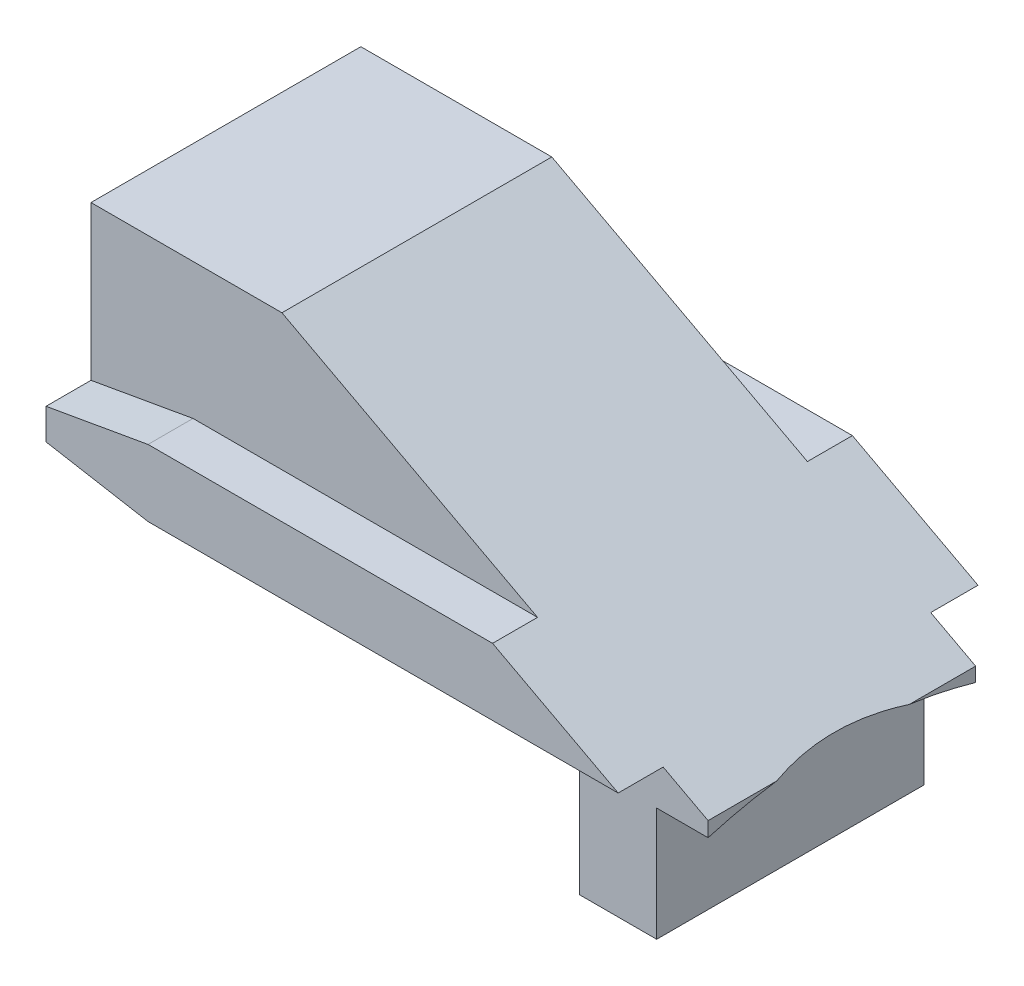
from build123d import *

# Parameters (mm, degrees)
BOSS_EXTRUDE1_DEPTH = 8.075
SKETCH3_R           = 18.58
CUT_EXTRUDE1_DEPTH  = 2
CUT_EXTRUDE2_START  = -24.01
CUT_EXTRUDE2_DEPTH  = 24.01
CHAMFER1_SIZE       = 0.7
CHAMFER1_SIZE2      = 3.969897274
CUT_EXTRUDE3_DEPTH  = 28.778169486
SCALE1_SCALE        = 0.9
BOSS_EXTRUDE2_DEPTH = 9.45


with BuildPart() as part:
    # Sketch1 → Boss-Extrude1 (new, symmetric)
    with BuildSketch(Plane.XY):
        Polygon((0, 11.71), (22.01, 0), (22.01, -5), (17.01, -5), (17.01, 0), (0, 0), (-2, 0), (-2, 11.71), align=None)
    extrude(amount=BOSS_EXTRUDE1_DEPTH, both=True)

    # Sketch3 → Cut-Extrude1 (cut)
    with BuildSketch(Plane(origin=(22.01, 0, 0), x_dir=(0, 0, -1), z_dir=(1, 0, 0))):
        with Locations((0, -18.4)):
            Circle(SKETCH3_R)
    extrude(amount=-CUT_EXTRUDE1_DEPTH, mode=Mode.SUBTRACT)

    # Sketch4 → Cut-Extrude2 (cut)
    with BuildSketch(Plane.ZY.offset(2).offset(CUT_EXTRUDE2_START)):
        Polygon((-5.25, 11.71), (-5.25, 3.53), (-7, 3.53), (-7, 0.93), (-5.16, 0.93), (-5.16, 0), (-5.16, -5), (-8.075, -5), (-8.075, 0), (-8.075, 11.71), align=None)
        Polygon((5.25, 0), (5.25, 0.93), (7, 0.93), (7, 3.53), (5.25, 3.53), (5.25, 11.71), (8.075, 11.71), (8.075, 0), (8.075, -5), (5.25, -5), align=None)
    extrude(amount=CUT_EXTRUDE2_DEPTH, mode=Mode.SUBTRACT)

    # Chamfer1
    chamfer1_edges = [part.edges().sort_by_distance(p)[0] for p in [
        (-2, 0.93, -6.08),
        (-2, 3.53, -6.125),
        (-2, 3.53, 6.125),
        (-2, 0.93, 6.125),
    ]]
    chamfer1_side = [part.faces().sort_by_distance(p)[0] for p in [
        (-2, 5.608458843, 0.003301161),
    ]]
    chamfer(chamfer1_edges, length=CHAMFER1_SIZE, length2=CHAMFER1_SIZE2, reference=chamfer1_side[0])

    # Sketch5 → Cut-Extrude3 (cut, through all)
    with BuildSketch(Plane(origin=(0, 0, -5.25), x_dir=(-1, 0, 0), z_dir=(0, 0, -1))):
        Polygon((2, 7.71), (-7.518360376, 7.71), (2, 12.77406179), align=None)
    extrude(amount=-CUT_EXTRUDE3_DEPTH, mode=Mode.SUBTRACT)


with BuildPart() as part_1:
    # Scale1: scaled about (8.147299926, 2.647709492, 0.01086278)
    add(part.part.scale(SCALE1_SCALE).moved(Location((0.814729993, 0.264770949, 0.001086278))))

    # Sketch6 → Boss-Extrude2 (add)
    with BuildSketch(Plane(origin=(0, 0, -4.723913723), x_dir=(-1, 0, 0), z_dir=(0, 0, -1))):
        Polygon((-7.581254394, 7.203770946), (-5.7016643, 8.203770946), (0.985269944, 8.203770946), (0.985269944, 7.203770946), align=None)
    extrude(amount=-BOSS_EXTRUDE2_DEPTH)


solid = part_1.part
